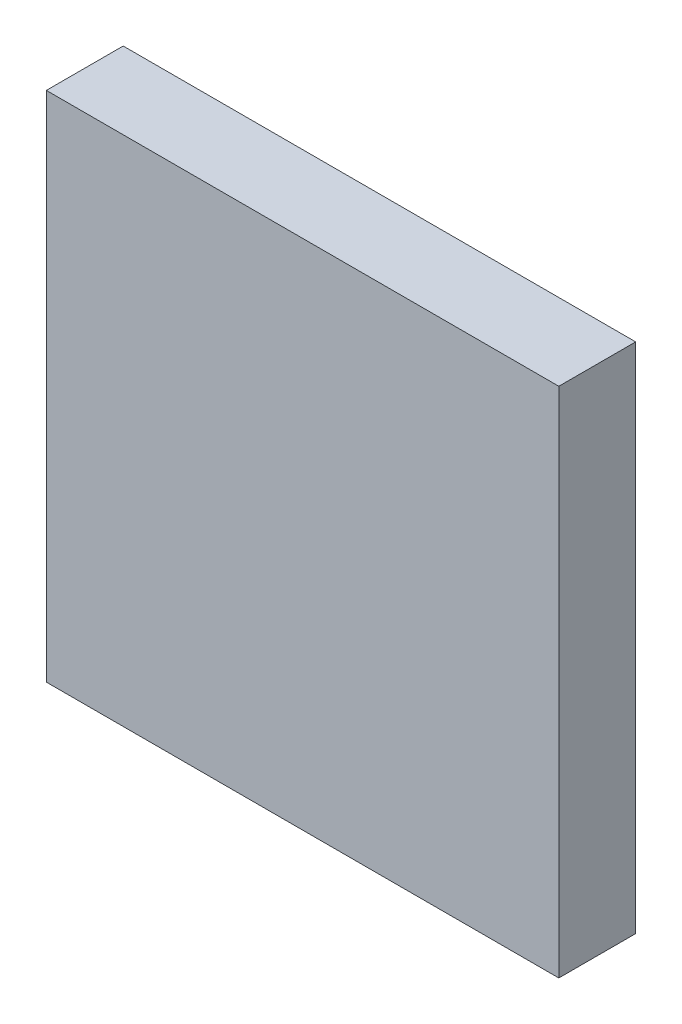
from build123d import *

# Parameters (mm, degrees)
SKETCH1_W      = 31.75
SKETCH1_H      = 31.75
EXTRUDE1_DEPTH = 4.7625


with BuildPart() as part:
    # Sketch1 → Extrude1 (new body)
    with BuildSketch(Plane.XY):
        Rectangle(SKETCH1_W, SKETCH1_H)
    extrude(amount=EXTRUDE1_DEPTH)


solid = part.part
